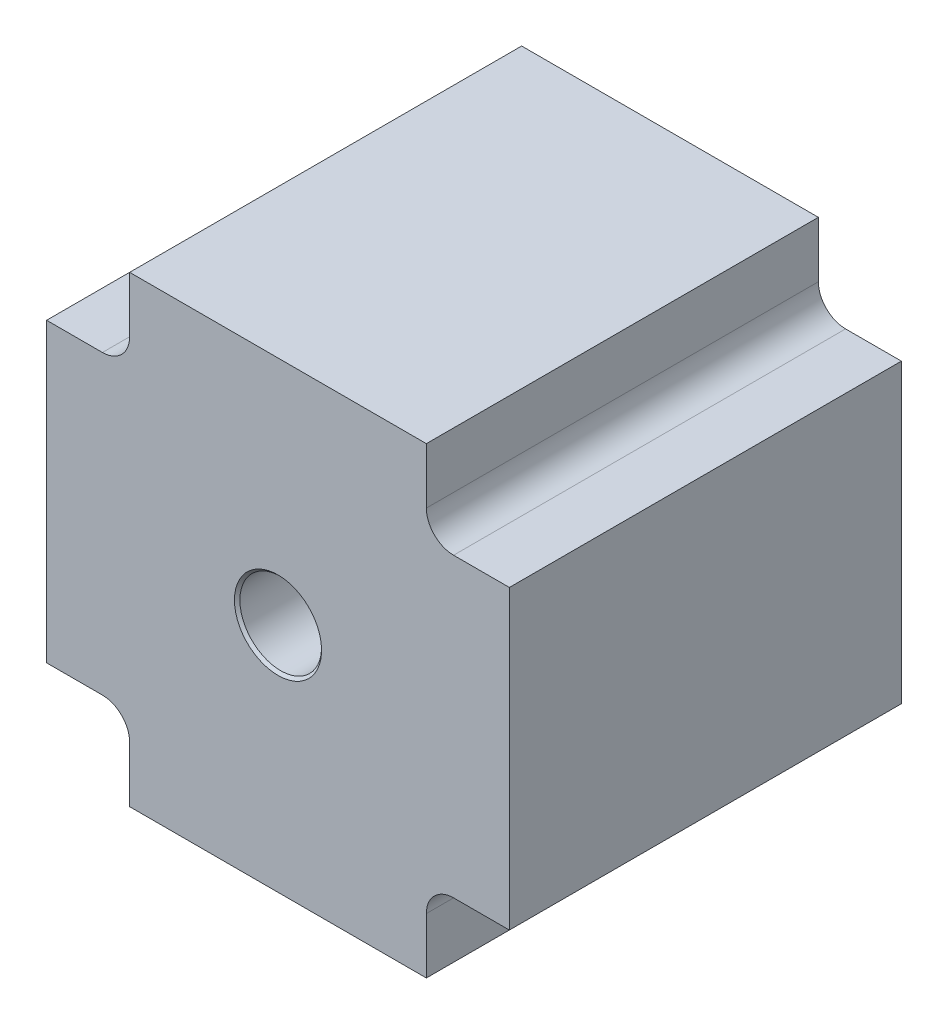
ISO-10303-21;
HEADER;
FILE_DESCRIPTION(('STEP AP214'),'2;1');
FILE_NAME('part.step','',(''),(''),'','','');
FILE_SCHEMA(('AUTOMOTIVE_DESIGN { 1 0 10303 214 1 1 1 1 }'));
ENDSEC;
DATA;
#1=APPLICATION_CONTEXT('core data for automotive mechanical design processes');
#2=APPLICATION_PROTOCOL_DEFINITION('international standard','automotive_design',2000,#1);
#3=PRODUCT_CONTEXT('',#1,'mechanical');
#4=PRODUCT('Part','Part','',(#3));
#5=PRODUCT_RELATED_PRODUCT_CATEGORY('part','',(#4));
#6=PRODUCT_DEFINITION_FORMATION('','',#4);
#7=PRODUCT_DEFINITION_CONTEXT('part definition',#1,'design');
#8=PRODUCT_DEFINITION('design','',#6,#7);
#9=PRODUCT_DEFINITION_SHAPE('','',#8);
#10=(LENGTH_UNIT() NAMED_UNIT(*) SI_UNIT(.MILLI.,.METRE.));
#11=(NAMED_UNIT(*) PLANE_ANGLE_UNIT() SI_UNIT($,.RADIAN.));
#12=(NAMED_UNIT(*) SI_UNIT($,.STERADIAN.) SOLID_ANGLE_UNIT());
#13=UNCERTAINTY_MEASURE_WITH_UNIT(LENGTH_MEASURE(1.E-05),#10,'distance_accuracy_value','');
#14=(GEOMETRIC_REPRESENTATION_CONTEXT(3) GLOBAL_UNCERTAINTY_ASSIGNED_CONTEXT((#13)) GLOBAL_UNIT_ASSIGNED_CONTEXT((#10,
#11,#12)) REPRESENTATION_CONTEXT('',''));
#15=CARTESIAN_POINT('',(0.,0.,0.));
#16=DIRECTION('',(0.,0.,1.));
#17=DIRECTION('',(1.,0.,0.));
#18=AXIS2_PLACEMENT_3D('',#15,#16,#17);
#19=CARTESIAN_POINT('',(-27.25,-27.25,72.));
#20=DIRECTION('',(1.,0.,0.));
#21=DIRECTION('',(0.,1.,0.));
#22=AXIS2_PLACEMENT_3D('',#19,#20,#21);
#23=PLANE('',#22);
#24=DIRECTION('',(0.,-1.,0.));
#25=VECTOR('',#24,1.);
#26=CARTESIAN_POINT('',(-27.25,-27.25,72.));
#27=LINE('',#26,#25);
#28=CARTESIAN_POINT('',(-27.25,-32.25,72.));
#29=VERTEX_POINT('',#28);
#30=CARTESIAN_POINT('',(-27.25,-42.5,72.));
#31=VERTEX_POINT('',#30);
#32=EDGE_CURVE('E149',#29,#31,#27,.T.);
#33=ORIENTED_EDGE('',*,*,#32,.F.);
#34=DIRECTION('',(0.,0.,-1.));
#35=VECTOR('',#34,1.);
#36=CARTESIAN_POINT('',(-27.25,-32.25,0.));
#37=LINE('',#36,#35);
#38=CARTESIAN_POINT('',(-27.25,-32.25,0.));
#39=VERTEX_POINT('',#38);
#40=EDGE_CURVE('E193',#29,#39,#37,.T.);
#41=ORIENTED_EDGE('',*,*,#40,.T.);
#42=DIRECTION('',(0.,-1.,0.));
#43=VECTOR('',#42,1.);
#44=CARTESIAN_POINT('',(-27.25,-27.25,0.));
#45=LINE('',#44,#43);
#46=CARTESIAN_POINT('',(-27.25,-42.5,0.));
#47=VERTEX_POINT('',#46);
#48=EDGE_CURVE('E174',#39,#47,#45,.T.);
#49=ORIENTED_EDGE('',*,*,#48,.T.);
#50=DIRECTION('',(0.,0.,-1.));
#51=VECTOR('',#50,1.);
#52=CARTESIAN_POINT('',(-27.25,-42.5,72.));
#53=LINE('',#52,#51);
#54=EDGE_CURVE('E167',#31,#47,#53,.T.);
#55=ORIENTED_EDGE('',*,*,#54,.F.);
#56=EDGE_LOOP('',(#33,#41,#49,#55));
#57=FACE_BOUND('',#56,.T.);
#58=ADVANCED_FACE('F37',(#57),#23,.F.);
#59=CARTESIAN_POINT('',(27.25,-42.5,72.));
#60=DIRECTION('',(0.,1.,0.));
#61=DIRECTION('',(-1.,0.,0.));
#62=AXIS2_PLACEMENT_3D('',#59,#60,#61);
#63=PLANE('',#62);
#64=DIRECTION('',(1.,0.,0.));
#65=VECTOR('',#64,1.);
#66=CARTESIAN_POINT('',(27.25,-42.5,0.));
#67=LINE('',#66,#65);
#68=CARTESIAN_POINT('',(27.25,-42.5,0.));
#69=VERTEX_POINT('',#68);
#70=EDGE_CURVE('E292',#47,#69,#67,.T.);
#71=ORIENTED_EDGE('',*,*,#70,.T.);
#72=DIRECTION('',(0.,0.,-1.));
#73=VECTOR('',#72,1.);
#74=CARTESIAN_POINT('',(27.25,-42.5,72.));
#75=LINE('',#74,#73);
#76=CARTESIAN_POINT('',(27.25,-42.5,72.));
#77=VERTEX_POINT('',#76);
#78=EDGE_CURVE('E169',#77,#69,#75,.T.);
#79=ORIENTED_EDGE('',*,*,#78,.F.);
#80=DIRECTION('',(1.,0.,0.));
#81=VECTOR('',#80,1.);
#82=CARTESIAN_POINT('',(27.25,-42.5,72.));
#83=LINE('',#82,#81);
#84=EDGE_CURVE('E154',#31,#77,#83,.T.);
#85=ORIENTED_EDGE('',*,*,#84,.F.);
#86=ORIENTED_EDGE('',*,*,#54,.T.);
#87=EDGE_LOOP('',(#71,#79,#85,#86));
#88=FACE_BOUND('',#87,.T.);
#89=ADVANCED_FACE('F166',(#88),#63,.F.);
#90=CARTESIAN_POINT('',(27.25,-27.25,72.));
#91=DIRECTION('',(-1.,0.,0.));
#92=DIRECTION('',(0.,0.,1.));
#93=AXIS2_PLACEMENT_3D('',#90,#91,#92);
#94=PLANE('',#93);
#95=DIRECTION('',(0.,1.,0.));
#96=VECTOR('',#95,1.);
#97=CARTESIAN_POINT('',(27.25,-27.25,0.));
#98=LINE('',#97,#96);
#99=CARTESIAN_POINT('',(27.25,-32.25,0.));
#100=VERTEX_POINT('',#99);
#101=EDGE_CURVE('E291',#69,#100,#98,.T.);
#102=ORIENTED_EDGE('',*,*,#101,.T.);
#103=DIRECTION('',(0.,0.,-1.));
#104=VECTOR('',#103,1.);
#105=CARTESIAN_POINT('',(27.25,-32.25,72.));
#106=LINE('',#105,#104);
#107=CARTESIAN_POINT('',(27.25,-32.25,72.));
#108=VERTEX_POINT('',#107);
#109=EDGE_CURVE('E200',#100,#108,#106,.F.);
#110=ORIENTED_EDGE('',*,*,#109,.T.);
#111=DIRECTION('',(0.,1.,0.));
#112=VECTOR('',#111,1.);
#113=CARTESIAN_POINT('',(27.25,-27.25,72.));
#114=LINE('',#113,#112);
#115=EDGE_CURVE('E171',#77,#108,#114,.T.);
#116=ORIENTED_EDGE('',*,*,#115,.F.);
#117=ORIENTED_EDGE('',*,*,#78,.T.);
#118=EDGE_LOOP('',(#102,#110,#116,#117));
#119=FACE_BOUND('',#118,.T.);
#120=ADVANCED_FACE('F317',(#119),#94,.F.);
#121=CARTESIAN_POINT('',(42.5,-27.25,72.));
#122=DIRECTION('',(0.,1.,0.));
#123=DIRECTION('',(0.,0.,1.));
#124=AXIS2_PLACEMENT_3D('',#121,#122,#123);
#125=PLANE('',#124);
#126=DIRECTION('',(1.,0.,0.));
#127=VECTOR('',#126,1.);
#128=CARTESIAN_POINT('',(42.5,-27.25,72.));
#129=LINE('',#128,#127);
#130=CARTESIAN_POINT('',(32.25,-27.25,72.));
#131=VERTEX_POINT('',#130);
#132=CARTESIAN_POINT('',(42.5,-27.25,72.));
#133=VERTEX_POINT('',#132);
#134=EDGE_CURVE('E307',#131,#133,#129,.T.);
#135=ORIENTED_EDGE('',*,*,#134,.F.);
#136=DIRECTION('',(0.,0.,-1.));
#137=VECTOR('',#136,1.);
#138=CARTESIAN_POINT('',(32.25,-27.25,0.));
#139=LINE('',#138,#137);
#140=CARTESIAN_POINT('',(32.25,-27.25,0.));
#141=VERTEX_POINT('',#140);
#142=EDGE_CURVE('E197',#131,#141,#139,.T.);
#143=ORIENTED_EDGE('',*,*,#142,.T.);
#144=DIRECTION('',(1.,0.,0.));
#145=VECTOR('',#144,1.);
#146=CARTESIAN_POINT('',(42.5,-27.25,0.));
#147=LINE('',#146,#145);
#148=CARTESIAN_POINT('',(42.5,-27.25,0.));
#149=VERTEX_POINT('',#148);
#150=EDGE_CURVE('E256',#141,#149,#147,.T.);
#151=ORIENTED_EDGE('',*,*,#150,.T.);
#152=DIRECTION('',(0.,0.,-1.));
#153=VECTOR('',#152,1.);
#154=CARTESIAN_POINT('',(42.5,-27.25,72.));
#155=LINE('',#154,#153);
#156=EDGE_CURVE('E181',#133,#149,#155,.T.);
#157=ORIENTED_EDGE('',*,*,#156,.F.);
#158=EDGE_LOOP('',(#135,#143,#151,#157));
#159=FACE_BOUND('',#158,.T.);
#160=ADVANCED_FACE('F315',(#159),#125,.F.);
#161=CARTESIAN_POINT('',(42.5,-27.25,72.));
#162=DIRECTION('',(-1.,0.,0.));
#163=DIRECTION('',(0.,0.,1.));
#164=AXIS2_PLACEMENT_3D('',#161,#162,#163);
#165=PLANE('',#164);
#166=DIRECTION('',(0.,1.,0.));
#167=VECTOR('',#166,1.);
#168=CARTESIAN_POINT('',(42.5,-27.25,0.));
#169=LINE('',#168,#167);
#170=CARTESIAN_POINT('',(42.5,27.25,0.));
#171=VERTEX_POINT('',#170);
#172=EDGE_CURVE('E252',#149,#171,#169,.T.);
#173=ORIENTED_EDGE('',*,*,#172,.T.);
#174=DIRECTION('',(0.,0.,-1.));
#175=VECTOR('',#174,1.);
#176=CARTESIAN_POINT('',(42.5,27.25,72.));
#177=LINE('',#176,#175);
#178=CARTESIAN_POINT('',(42.5,27.25,72.));
#179=VERTEX_POINT('',#178);
#180=EDGE_CURVE('E251',#179,#171,#177,.T.);
#181=ORIENTED_EDGE('',*,*,#180,.F.);
#182=DIRECTION('',(0.,1.,0.));
#183=VECTOR('',#182,1.);
#184=CARTESIAN_POINT('',(42.5,-27.25,72.));
#185=LINE('',#184,#183);
#186=EDGE_CURVE('E285',#133,#179,#185,.T.);
#187=ORIENTED_EDGE('',*,*,#186,.F.);
#188=ORIENTED_EDGE('',*,*,#156,.T.);
#189=EDGE_LOOP('',(#173,#181,#187,#188));
#190=FACE_BOUND('',#189,.T.);
#191=ADVANCED_FACE('F284',(#190),#165,.F.);
#192=CARTESIAN_POINT('',(42.5,27.25,72.));
#193=DIRECTION('',(0.,-1.,0.));
#194=DIRECTION('',(1.,0.,0.));
#195=AXIS2_PLACEMENT_3D('',#192,#193,#194);
#196=PLANE('',#195);
#197=DIRECTION('',(-1.,0.,0.));
#198=VECTOR('',#197,1.);
#199=CARTESIAN_POINT('',(42.5,27.25,0.));
#200=LINE('',#199,#198);
#201=CARTESIAN_POINT('',(32.25,27.25,0.));
#202=VERTEX_POINT('',#201);
#203=EDGE_CURVE('E244',#171,#202,#200,.T.);
#204=ORIENTED_EDGE('',*,*,#203,.T.);
#205=DIRECTION('',(0.,0.,-1.));
#206=VECTOR('',#205,1.);
#207=CARTESIAN_POINT('',(32.25,27.25,72.));
#208=LINE('',#207,#206);
#209=CARTESIAN_POINT('',(32.25,27.25,72.));
#210=VERTEX_POINT('',#209);
#211=EDGE_CURVE('E205',#202,#210,#208,.F.);
#212=ORIENTED_EDGE('',*,*,#211,.T.);
#213=DIRECTION('',(-1.,0.,0.));
#214=VECTOR('',#213,1.);
#215=CARTESIAN_POINT('',(42.5,27.25,72.));
#216=LINE('',#215,#214);
#217=EDGE_CURVE('E227',#179,#210,#216,.T.);
#218=ORIENTED_EDGE('',*,*,#217,.F.);
#219=ORIENTED_EDGE('',*,*,#180,.T.);
#220=EDGE_LOOP('',(#204,#212,#218,#219));
#221=FACE_BOUND('',#220,.T.);
#222=ADVANCED_FACE('F249',(#221),#196,.F.);
#223=CARTESIAN_POINT('',(27.25,42.5,72.));
#224=DIRECTION('',(-1.,0.,0.));
#225=DIRECTION('',(0.,-1.,0.));
#226=AXIS2_PLACEMENT_3D('',#223,#224,#225);
#227=PLANE('',#226);
#228=DIRECTION('',(0.,1.,0.));
#229=VECTOR('',#228,1.);
#230=CARTESIAN_POINT('',(27.25,42.5,72.));
#231=LINE('',#230,#229);
#232=CARTESIAN_POINT('',(27.25,32.25,72.));
#233=VERTEX_POINT('',#232);
#234=CARTESIAN_POINT('',(27.25,42.5,72.));
#235=VERTEX_POINT('',#234);
#236=EDGE_CURVE('E224',#233,#235,#231,.T.);
#237=ORIENTED_EDGE('',*,*,#236,.F.);
#238=DIRECTION('',(0.,0.,-1.));
#239=VECTOR('',#238,1.);
#240=CARTESIAN_POINT('',(27.25,32.25,0.));
#241=LINE('',#240,#239);
#242=CARTESIAN_POINT('',(27.25,32.25,0.));
#243=VERTEX_POINT('',#242);
#244=EDGE_CURVE('E202',#233,#243,#241,.T.);
#245=ORIENTED_EDGE('',*,*,#244,.T.);
#246=DIRECTION('',(0.,1.,0.));
#247=VECTOR('',#246,1.);
#248=CARTESIAN_POINT('',(27.25,42.5,0.));
#249=LINE('',#248,#247);
#250=CARTESIAN_POINT('',(27.25,42.5,0.));
#251=VERTEX_POINT('',#250);
#252=EDGE_CURVE('E246',#243,#251,#249,.T.);
#253=ORIENTED_EDGE('',*,*,#252,.T.);
#254=DIRECTION('',(0.,0.,-1.));
#255=VECTOR('',#254,1.);
#256=CARTESIAN_POINT('',(27.25,42.5,72.));
#257=LINE('',#256,#255);
#258=EDGE_CURVE('E235',#235,#251,#257,.T.);
#259=ORIENTED_EDGE('',*,*,#258,.F.);
#260=EDGE_LOOP('',(#237,#245,#253,#259));
#261=FACE_BOUND('',#260,.T.);
#262=ADVANCED_FACE('F232',(#261),#227,.F.);
#263=CARTESIAN_POINT('',(27.25,42.5,72.));
#264=DIRECTION('',(0.,-1.,0.));
#265=DIRECTION('',(1.,0.,0.));
#266=AXIS2_PLACEMENT_3D('',#263,#264,#265);
#267=PLANE('',#266);
#268=DIRECTION('',(-1.,0.,0.));
#269=VECTOR('',#268,1.);
#270=CARTESIAN_POINT('',(27.25,42.5,0.));
#271=LINE('',#270,#269);
#272=CARTESIAN_POINT('',(-27.25,42.5,0.));
#273=VERTEX_POINT('',#272);
#274=EDGE_CURVE('E254',#251,#273,#271,.T.);
#275=ORIENTED_EDGE('',*,*,#274,.T.);
#276=DIRECTION('',(0.,0.,-1.));
#277=VECTOR('',#276,1.);
#278=CARTESIAN_POINT('',(-27.25,42.5,72.));
#279=LINE('',#278,#277);
#280=CARTESIAN_POINT('',(-27.25,42.5,72.));
#281=VERTEX_POINT('',#280);
#282=EDGE_CURVE('E276',#281,#273,#279,.T.);
#283=ORIENTED_EDGE('',*,*,#282,.F.);
#284=DIRECTION('',(-1.,0.,0.));
#285=VECTOR('',#284,1.);
#286=CARTESIAN_POINT('',(27.25,42.5,72.));
#287=LINE('',#286,#285);
#288=EDGE_CURVE('E237',#235,#281,#287,.T.);
#289=ORIENTED_EDGE('',*,*,#288,.F.);
#290=ORIENTED_EDGE('',*,*,#258,.T.);
#291=EDGE_LOOP('',(#275,#283,#289,#290));
#292=FACE_BOUND('',#291,.T.);
#293=ADVANCED_FACE('F385',(#292),#267,.F.);
#294=CARTESIAN_POINT('',(-27.25,42.5,72.));
#295=DIRECTION('',(1.,0.,0.));
#296=DIRECTION('',(0.,0.,-1.));
#297=AXIS2_PLACEMENT_3D('',#294,#295,#296);
#298=PLANE('',#297);
#299=DIRECTION('',(0.,-1.,0.));
#300=VECTOR('',#299,1.);
#301=CARTESIAN_POINT('',(-27.25,42.5,0.));
#302=LINE('',#301,#300);
#303=CARTESIAN_POINT('',(-27.25,32.25,0.));
#304=VERTEX_POINT('',#303);
#305=EDGE_CURVE('E261',#273,#304,#302,.T.);
#306=ORIENTED_EDGE('',*,*,#305,.T.);
#307=DIRECTION('',(0.,0.,-1.));
#308=VECTOR('',#307,1.);
#309=CARTESIAN_POINT('',(-27.25,32.25,72.));
#310=LINE('',#309,#308);
#311=CARTESIAN_POINT('',(-27.25,32.25,72.));
#312=VERTEX_POINT('',#311);
#313=EDGE_CURVE('E52',#304,#312,#310,.F.);
#314=ORIENTED_EDGE('',*,*,#313,.T.);
#315=DIRECTION('',(0.,-1.,0.));
#316=VECTOR('',#315,1.);
#317=CARTESIAN_POINT('',(-27.25,42.5,72.));
#318=LINE('',#317,#316);
#319=EDGE_CURVE('E302',#281,#312,#318,.T.);
#320=ORIENTED_EDGE('',*,*,#319,.F.);
#321=ORIENTED_EDGE('',*,*,#282,.T.);
#322=EDGE_LOOP('',(#306,#314,#320,#321));
#323=FACE_BOUND('',#322,.T.);
#324=ADVANCED_FACE('F382',(#323),#298,.F.);
#325=CARTESIAN_POINT('',(-27.25,27.25,72.));
#326=DIRECTION('',(0.,-1.,0.));
#327=DIRECTION('',(0.,0.,-1.));
#328=AXIS2_PLACEMENT_3D('',#325,#326,#327);
#329=PLANE('',#328);
#330=DIRECTION('',(-1.,0.,0.));
#331=VECTOR('',#330,1.);
#332=CARTESIAN_POINT('',(-27.25,27.25,72.));
#333=LINE('',#332,#331);
#334=CARTESIAN_POINT('',(-32.25,27.25,72.));
#335=VERTEX_POINT('',#334);
#336=CARTESIAN_POINT('',(-42.5,27.25,72.));
#337=VERTEX_POINT('',#336);
#338=EDGE_CURVE('E300',#335,#337,#333,.T.);
#339=ORIENTED_EDGE('',*,*,#338,.F.);
#340=DIRECTION('',(0.,0.,-1.));
#341=VECTOR('',#340,1.);
#342=CARTESIAN_POINT('',(-32.25,27.25,0.));
#343=LINE('',#342,#341);
#344=CARTESIAN_POINT('',(-32.25,27.25,0.));
#345=VERTEX_POINT('',#344);
#346=EDGE_CURVE('E207',#335,#345,#343,.T.);
#347=ORIENTED_EDGE('',*,*,#346,.T.);
#348=DIRECTION('',(-1.,0.,0.));
#349=VECTOR('',#348,1.);
#350=CARTESIAN_POINT('',(-27.25,27.25,0.));
#351=LINE('',#350,#349);
#352=CARTESIAN_POINT('',(-42.5,27.25,0.));
#353=VERTEX_POINT('',#352);
#354=EDGE_CURVE('E263',#345,#353,#351,.T.);
#355=ORIENTED_EDGE('',*,*,#354,.T.);
#356=DIRECTION('',(0.,0.,-1.));
#357=VECTOR('',#356,1.);
#358=CARTESIAN_POINT('',(-42.5,27.25,72.));
#359=LINE('',#358,#357);
#360=EDGE_CURVE('E272',#337,#353,#359,.T.);
#361=ORIENTED_EDGE('',*,*,#360,.F.);
#362=EDGE_LOOP('',(#339,#347,#355,#361));
#363=FACE_BOUND('',#362,.T.);
#364=ADVANCED_FACE('F358',(#363),#329,.F.);
#365=CARTESIAN_POINT('',(-42.5,-27.25,72.));
#366=DIRECTION('',(1.,0.,0.));
#367=DIRECTION('',(0.,0.,-1.));
#368=AXIS2_PLACEMENT_3D('',#365,#366,#367);
#369=PLANE('',#368);
#370=DIRECTION('',(0.,-1.,0.));
#371=VECTOR('',#370,1.);
#372=CARTESIAN_POINT('',(-42.5,-27.25,0.));
#373=LINE('',#372,#371);
#374=CARTESIAN_POINT('',(-42.5,-27.25,0.));
#375=VERTEX_POINT('',#374);
#376=EDGE_CURVE('E265',#353,#375,#373,.T.);
#377=ORIENTED_EDGE('',*,*,#376,.T.);
#378=DIRECTION('',(0.,0.,-1.));
#379=VECTOR('',#378,1.);
#380=CARTESIAN_POINT('',(-42.5,-27.25,72.));
#381=LINE('',#380,#379);
#382=CARTESIAN_POINT('',(-42.5,-27.25,72.));
#383=VERTEX_POINT('',#382);
#384=EDGE_CURVE('E269',#383,#375,#381,.T.);
#385=ORIENTED_EDGE('',*,*,#384,.F.);
#386=DIRECTION('',(0.,-1.,0.));
#387=VECTOR('',#386,1.);
#388=CARTESIAN_POINT('',(-42.5,-27.25,72.));
#389=LINE('',#388,#387);
#390=EDGE_CURVE('E298',#337,#383,#389,.T.);
#391=ORIENTED_EDGE('',*,*,#390,.F.);
#392=ORIENTED_EDGE('',*,*,#360,.T.);
#393=EDGE_LOOP('',(#377,#385,#391,#392));
#394=FACE_BOUND('',#393,.T.);
#395=ADVANCED_FACE('F363',(#394),#369,.F.);
#396=CARTESIAN_POINT('',(-27.25,-27.25,72.));
#397=DIRECTION('',(0.,1.,0.));
#398=DIRECTION('',(-1.,0.,0.));
#399=AXIS2_PLACEMENT_3D('',#396,#397,#398);
#400=PLANE('',#399);
#401=DIRECTION('',(1.,0.,0.));
#402=VECTOR('',#401,1.);
#403=CARTESIAN_POINT('',(-27.25,-27.25,0.));
#404=LINE('',#403,#402);
#405=CARTESIAN_POINT('',(-32.25,-27.25,0.));
#406=VERTEX_POINT('',#405);
#407=EDGE_CURVE('E162',#375,#406,#404,.T.);
#408=ORIENTED_EDGE('',*,*,#407,.T.);
#409=DIRECTION('',(0.,0.,-1.));
#410=VECTOR('',#409,1.);
#411=CARTESIAN_POINT('',(-32.25,-27.25,72.));
#412=LINE('',#411,#410);
#413=CARTESIAN_POINT('',(-32.25,-27.25,72.));
#414=VERTEX_POINT('',#413);
#415=EDGE_CURVE('E195',#406,#414,#412,.F.);
#416=ORIENTED_EDGE('',*,*,#415,.T.);
#417=DIRECTION('',(1.,0.,0.));
#418=VECTOR('',#417,1.);
#419=CARTESIAN_POINT('',(-27.25,-27.25,72.));
#420=LINE('',#419,#418);
#421=EDGE_CURVE('E273',#383,#414,#420,.T.);
#422=ORIENTED_EDGE('',*,*,#421,.F.);
#423=ORIENTED_EDGE('',*,*,#384,.T.);
#424=EDGE_LOOP('',(#408,#416,#422,#423));
#425=FACE_BOUND('',#424,.T.);
#426=ADVANCED_FACE('F368',(#425),#400,.F.);
#427=CARTESIAN_POINT('',(0.,0.,72.));
#428=DIRECTION('',(0.,0.,-1.));
#429=DIRECTION('',(-1.,0.,0.));
#430=AXIS2_PLACEMENT_3D('',#427,#428,#429);
#431=PLANE('',#430);
#432=CARTESIAN_POINT('',(0.,0.,72.));
#433=DIRECTION('',(0.,0.,-1.));
#434=DIRECTION('',(-1.,0.,0.));
#435=AXIS2_PLACEMENT_3D('',#432,#433,#434);
#436=CIRCLE('',#435,8.00000000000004);
#437=CARTESIAN_POINT('',(-8.00000000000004,0.,72.));
#438=VERTEX_POINT('',#437);
#439=EDGE_CURVE('E190',#438,#438,#436,.T.);
#440=ORIENTED_EDGE('',*,*,#439,.T.);
#441=EDGE_LOOP('',(#440));
#442=FACE_BOUND('',#441,.T.);
#443=ORIENTED_EDGE('',*,*,#421,.T.);
#444=CARTESIAN_POINT('',(-32.25,-32.25,72.));
#445=DIRECTION('',(0.,0.,-1.));
#446=DIRECTION('',(-1.,0.,0.));
#447=AXIS2_PLACEMENT_3D('',#444,#445,#446);
#448=CIRCLE('',#447,5.);
#449=EDGE_CURVE('E157',#414,#29,#448,.T.);
#450=ORIENTED_EDGE('',*,*,#449,.T.);
#451=ORIENTED_EDGE('',*,*,#32,.T.);
#452=ORIENTED_EDGE('',*,*,#84,.T.);
#453=ORIENTED_EDGE('',*,*,#115,.T.);
#454=CARTESIAN_POINT('',(32.25,-32.25,72.));
#455=DIRECTION('',(0.,0.,-1.));
#456=DIRECTION('',(-1.,0.,0.));
#457=AXIS2_PLACEMENT_3D('',#454,#455,#456);
#458=CIRCLE('',#457,5.);
#459=EDGE_CURVE('E216',#108,#131,#458,.T.);
#460=ORIENTED_EDGE('',*,*,#459,.T.);
#461=ORIENTED_EDGE('',*,*,#134,.T.);
#462=ORIENTED_EDGE('',*,*,#186,.T.);
#463=ORIENTED_EDGE('',*,*,#217,.T.);
#464=CARTESIAN_POINT('',(32.25,32.25,72.));
#465=DIRECTION('',(0.,0.,-1.));
#466=DIRECTION('',(-1.,0.,0.));
#467=AXIS2_PLACEMENT_3D('',#464,#465,#466);
#468=CIRCLE('',#467,5.);
#469=EDGE_CURVE('E220',#210,#233,#468,.T.);
#470=ORIENTED_EDGE('',*,*,#469,.T.);
#471=ORIENTED_EDGE('',*,*,#236,.T.);
#472=ORIENTED_EDGE('',*,*,#288,.T.);
#473=ORIENTED_EDGE('',*,*,#319,.T.);
#474=CARTESIAN_POINT('',(-32.25,32.25,72.));
#475=DIRECTION('',(0.,0.,-1.));
#476=DIRECTION('',(-1.,0.,0.));
#477=AXIS2_PLACEMENT_3D('',#474,#475,#476);
#478=CIRCLE('',#477,5.);
#479=EDGE_CURVE('E11',#312,#335,#478,.T.);
#480=ORIENTED_EDGE('',*,*,#479,.T.);
#481=ORIENTED_EDGE('',*,*,#338,.T.);
#482=ORIENTED_EDGE('',*,*,#390,.T.);
#483=EDGE_LOOP('',(#443,#450,#451,#452,#453,#460,#461,#462,#463,#470,#471,#472,#473,#480,#481,#482));
#484=FACE_BOUND('',#483,.T.);
#485=ADVANCED_FACE('F152',(#442,#484),#431,.F.);
#486=CARTESIAN_POINT('',(0.,0.,0.));
#487=DIRECTION('',(0.,0.,-1.));
#488=DIRECTION('',(-1.,0.,0.));
#489=AXIS2_PLACEMENT_3D('',#486,#487,#488);
#490=PLANE('',#489);
#491=CARTESIAN_POINT('',(0.,0.,0.));
#492=DIRECTION('',(0.,0.,-1.));
#493=DIRECTION('',(-1.,0.,0.));
#494=AXIS2_PLACEMENT_3D('',#491,#492,#493);
#495=CIRCLE('',#494,7.99999999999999);
#496=CARTESIAN_POINT('',(-7.99999999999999,0.,0.));
#497=VERTEX_POINT('',#496);
#498=EDGE_CURVE('E176',#497,#497,#495,.F.);
#499=ORIENTED_EDGE('',*,*,#498,.T.);
#500=EDGE_LOOP('',(#499));
#501=FACE_BOUND('',#500,.T.);
#502=ORIENTED_EDGE('',*,*,#48,.F.);
#503=CARTESIAN_POINT('',(-32.25,-32.25,0.));
#504=DIRECTION('',(0.,0.,-1.));
#505=DIRECTION('',(-1.,0.,0.));
#506=AXIS2_PLACEMENT_3D('',#503,#504,#505);
#507=CIRCLE('',#506,5.);
#508=EDGE_CURVE('E211',#39,#406,#507,.F.);
#509=ORIENTED_EDGE('',*,*,#508,.T.);
#510=ORIENTED_EDGE('',*,*,#407,.F.);
#511=ORIENTED_EDGE('',*,*,#376,.F.);
#512=ORIENTED_EDGE('',*,*,#354,.F.);
#513=CARTESIAN_POINT('',(-32.25,32.25,0.));
#514=DIRECTION('',(0.,0.,-1.));
#515=DIRECTION('',(-1.,0.,0.));
#516=AXIS2_PLACEMENT_3D('',#513,#514,#515);
#517=CIRCLE('',#516,5.);
#518=EDGE_CURVE('E45',#345,#304,#517,.F.);
#519=ORIENTED_EDGE('',*,*,#518,.T.);
#520=ORIENTED_EDGE('',*,*,#305,.F.);
#521=ORIENTED_EDGE('',*,*,#274,.F.);
#522=ORIENTED_EDGE('',*,*,#252,.F.);
#523=CARTESIAN_POINT('',(32.25,32.25,0.));
#524=DIRECTION('',(0.,0.,-1.));
#525=DIRECTION('',(-1.,0.,0.));
#526=AXIS2_PLACEMENT_3D('',#523,#524,#525);
#527=CIRCLE('',#526,5.);
#528=EDGE_CURVE('E218',#243,#202,#527,.F.);
#529=ORIENTED_EDGE('',*,*,#528,.T.);
#530=ORIENTED_EDGE('',*,*,#203,.F.);
#531=ORIENTED_EDGE('',*,*,#172,.F.);
#532=ORIENTED_EDGE('',*,*,#150,.F.);
#533=CARTESIAN_POINT('',(32.25,-32.25,0.));
#534=DIRECTION('',(0.,0.,-1.));
#535=DIRECTION('',(-1.,0.,0.));
#536=AXIS2_PLACEMENT_3D('',#533,#534,#535);
#537=CIRCLE('',#536,5.);
#538=EDGE_CURVE('E214',#141,#100,#537,.F.);
#539=ORIENTED_EDGE('',*,*,#538,.T.);
#540=ORIENTED_EDGE('',*,*,#101,.F.);
#541=ORIENTED_EDGE('',*,*,#70,.F.);
#542=EDGE_LOOP('',(#502,#509,#510,#511,#512,#519,#520,#521,#522,#529,#530,#531,#532,#539,#540,#541));
#543=FACE_BOUND('',#542,.T.);
#544=ADVANCED_FACE('F242',(#501,#543),#490,.T.);
#545=CARTESIAN_POINT('',(0.,0.,0.));
#546=DIRECTION('',(0.,0.,1.));
#547=DIRECTION('',(1.,0.,0.));
#548=AXIS2_PLACEMENT_3D('',#545,#546,#547);
#549=CYLINDRICAL_SURFACE('',#548,7.5);
#550=CARTESIAN_POINT('',(0.,0.,0.500000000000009));
#551=DIRECTION('',(0.,0.,-1.));
#552=DIRECTION('',(-1.,0.,0.));
#553=AXIS2_PLACEMENT_3D('',#550,#551,#552);
#554=CIRCLE('',#553,7.5);
#555=CARTESIAN_POINT('',(-7.5,0.,0.500000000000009));
#556=VERTEX_POINT('',#555);
#557=EDGE_CURVE('E187',#556,#556,#554,.T.);
#558=ORIENTED_EDGE('',*,*,#557,.T.);
#559=EDGE_LOOP('',(#558));
#560=FACE_BOUND('',#559,.T.);
#561=CARTESIAN_POINT('',(0.,0.,71.4999999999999));
#562=DIRECTION('',(0.,0.,-1.));
#563=DIRECTION('',(-1.,0.,0.));
#564=AXIS2_PLACEMENT_3D('',#561,#562,#563);
#565=CIRCLE('',#564,7.5);
#566=CARTESIAN_POINT('',(-7.5,0.,71.4999999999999));
#567=VERTEX_POINT('',#566);
#568=EDGE_CURVE('E179',#567,#567,#565,.F.);
#569=ORIENTED_EDGE('',*,*,#568,.T.);
#570=EDGE_LOOP('',(#569));
#571=FACE_BOUND('',#570,.T.);
#572=ADVANCED_FACE('F336',(#560,#571),#549,.F.);
#573=CARTESIAN_POINT('',(0.,0.,0.));
#574=DIRECTION('',(0.,0.,-1.));
#575=DIRECTION('',(-1.,0.,0.));
#576=AXIS2_PLACEMENT_3D('',#573,#574,#575);
#577=CONICAL_SURFACE('',#576,7.99999999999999,0.785398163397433);
#578=ORIENTED_EDGE('',*,*,#557,.F.);
#579=EDGE_LOOP('',(#578));
#580=FACE_BOUND('',#579,.T.);
#581=ORIENTED_EDGE('',*,*,#498,.F.);
#582=EDGE_LOOP('',(#581));
#583=FACE_BOUND('',#582,.T.);
#584=ADVANCED_FACE('F332',(#580,#583),#577,.F.);
#585=CARTESIAN_POINT('',(0.,0.,71.4999999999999));
#586=DIRECTION('',(0.,0.,1.));
#587=DIRECTION('',(1.,0.,0.));
#588=AXIS2_PLACEMENT_3D('',#585,#586,#587);
#589=CONICAL_SURFACE('',#588,7.5,0.785398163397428);
#590=ORIENTED_EDGE('',*,*,#439,.F.);
#591=EDGE_LOOP('',(#590));
#592=FACE_BOUND('',#591,.T.);
#593=ORIENTED_EDGE('',*,*,#568,.F.);
#594=EDGE_LOOP('',(#593));
#595=FACE_BOUND('',#594,.T.);
#596=ADVANCED_FACE('F335',(#592,#595),#589,.F.);
#597=CARTESIAN_POINT('',(-32.25,-32.25,72.));
#598=DIRECTION('',(0.,0.,1.));
#599=DIRECTION('',(1.,0.,0.));
#600=AXIS2_PLACEMENT_3D('',#597,#598,#599);
#601=CYLINDRICAL_SURFACE('',#600,5.);
#602=ORIENTED_EDGE('',*,*,#449,.F.);
#603=ORIENTED_EDGE('',*,*,#415,.F.);
#604=ORIENTED_EDGE('',*,*,#508,.F.);
#605=ORIENTED_EDGE('',*,*,#40,.F.);
#606=EDGE_LOOP('',(#602,#603,#604,#605));
#607=FACE_BOUND('',#606,.T.);
#608=ADVANCED_FACE('F340',(#607),#601,.F.);
#609=CARTESIAN_POINT('',(32.25,-32.25,72.));
#610=DIRECTION('',(0.,0.,1.));
#611=DIRECTION('',(1.,0.,0.));
#612=AXIS2_PLACEMENT_3D('',#609,#610,#611);
#613=CYLINDRICAL_SURFACE('',#612,5.);
#614=ORIENTED_EDGE('',*,*,#459,.F.);
#615=ORIENTED_EDGE('',*,*,#109,.F.);
#616=ORIENTED_EDGE('',*,*,#538,.F.);
#617=ORIENTED_EDGE('',*,*,#142,.F.);
#618=EDGE_LOOP('',(#614,#615,#616,#617));
#619=FACE_BOUND('',#618,.T.);
#620=ADVANCED_FACE('F314',(#619),#613,.F.);
#621=CARTESIAN_POINT('',(32.25,32.25,72.));
#622=DIRECTION('',(0.,0.,1.));
#623=DIRECTION('',(1.,0.,0.));
#624=AXIS2_PLACEMENT_3D('',#621,#622,#623);
#625=CYLINDRICAL_SURFACE('',#624,5.);
#626=ORIENTED_EDGE('',*,*,#469,.F.);
#627=ORIENTED_EDGE('',*,*,#211,.F.);
#628=ORIENTED_EDGE('',*,*,#528,.F.);
#629=ORIENTED_EDGE('',*,*,#244,.F.);
#630=EDGE_LOOP('',(#626,#627,#628,#629));
#631=FACE_BOUND('',#630,.T.);
#632=ADVANCED_FACE('F239',(#631),#625,.F.);
#633=CARTESIAN_POINT('',(-32.25,32.25,72.));
#634=DIRECTION('',(0.,0.,1.));
#635=DIRECTION('',(1.,0.,0.));
#636=AXIS2_PLACEMENT_3D('',#633,#634,#635);
#637=CYLINDRICAL_SURFACE('',#636,5.);
#638=ORIENTED_EDGE('',*,*,#479,.F.);
#639=ORIENTED_EDGE('',*,*,#313,.F.);
#640=ORIENTED_EDGE('',*,*,#518,.F.);
#641=ORIENTED_EDGE('',*,*,#346,.F.);
#642=EDGE_LOOP('',(#638,#639,#640,#641));
#643=FACE_BOUND('',#642,.T.);
#644=ADVANCED_FACE('F39',(#643),#637,.F.);
#645=CLOSED_SHELL('',(#58,#89,#120,#160,#191,#222,#262,#293,#324,#364,#395,#426,#485,#544,#572,
#584,#596,#608,#620,#632,#644));
#646=MANIFOLD_SOLID_BREP('B2',#645);
#647=ADVANCED_BREP_SHAPE_REPRESENTATION('',(#18,#646),#14);
#648=SHAPE_DEFINITION_REPRESENTATION(#9,#647);
ENDSEC;
END-ISO-10303-21;
